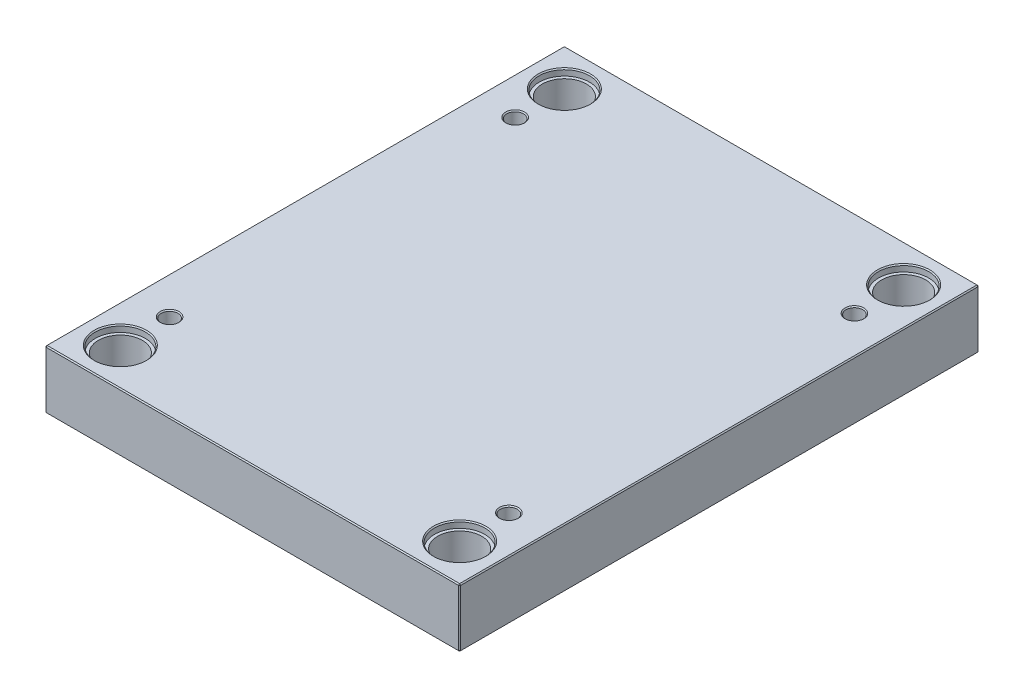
ISO-10303-21;
HEADER;
FILE_DESCRIPTION(('STEP AP214'),'2;1');
FILE_NAME('part.step','',(''),(''),'','','');
FILE_SCHEMA(('AUTOMOTIVE_DESIGN { 1 0 10303 214 1 1 1 1 }'));
ENDSEC;
DATA;
#1=APPLICATION_CONTEXT('core data for automotive mechanical design processes');
#2=APPLICATION_PROTOCOL_DEFINITION('international standard','automotive_design',2000,#1);
#3=PRODUCT_CONTEXT('',#1,'mechanical');
#4=PRODUCT('Part','Part','',(#3));
#5=PRODUCT_RELATED_PRODUCT_CATEGORY('part','',(#4));
#6=PRODUCT_DEFINITION_FORMATION('','',#4);
#7=PRODUCT_DEFINITION_CONTEXT('part definition',#1,'design');
#8=PRODUCT_DEFINITION('design','',#6,#7);
#9=PRODUCT_DEFINITION_SHAPE('','',#8);
#10=(LENGTH_UNIT() NAMED_UNIT(*) SI_UNIT(.MILLI.,.METRE.));
#11=(NAMED_UNIT(*) PLANE_ANGLE_UNIT() SI_UNIT($,.RADIAN.));
#12=(NAMED_UNIT(*) SI_UNIT($,.STERADIAN.) SOLID_ANGLE_UNIT());
#13=UNCERTAINTY_MEASURE_WITH_UNIT(LENGTH_MEASURE(1.E-05),#10,'distance_accuracy_value','');
#14=(GEOMETRIC_REPRESENTATION_CONTEXT(3) GLOBAL_UNCERTAINTY_ASSIGNED_CONTEXT((#13)) GLOBAL_UNIT_ASSIGNED_CONTEXT((#10,
#11,#12)) REPRESENTATION_CONTEXT('',''));
#15=CARTESIAN_POINT('',(0.,0.,0.));
#16=DIRECTION('',(0.,0.,1.));
#17=DIRECTION('',(1.,0.,0.));
#18=AXIS2_PLACEMENT_3D('',#15,#16,#17);
#19=CARTESIAN_POINT('',(-162.,0.,-212.));
#20=DIRECTION('',(0.,1.,0.));
#21=DIRECTION('',(0.,0.,1.));
#22=AXIS2_PLACEMENT_3D('',#19,#20,#21);
#23=CYLINDRICAL_SURFACE('',#22,21.);
#24=CARTESIAN_POINT('',(-162.,1.,-212.));
#25=DIRECTION('',(0.,1.,0.));
#26=DIRECTION('',(0.,0.,1.));
#27=AXIS2_PLACEMENT_3D('',#24,#25,#26);
#28=CIRCLE('',#27,21.);
#29=CARTESIAN_POINT('',(-162.,1.,-191.));
#30=VERTEX_POINT('',#29);
#31=EDGE_CURVE('E472',#30,#30,#28,.F.);
#32=ORIENTED_EDGE('',*,*,#31,.T.);
#33=EDGE_LOOP('',(#32));
#34=FACE_BOUND('',#33,.T.);
#35=CARTESIAN_POINT('',(-162.,49.7,-212.));
#36=DIRECTION('',(0.,1.,0.));
#37=DIRECTION('',(0.,0.,1.));
#38=AXIS2_PLACEMENT_3D('',#35,#36,#37);
#39=CIRCLE('',#38,21.);
#40=CARTESIAN_POINT('',(-162.,49.7,-191.));
#41=VERTEX_POINT('',#40);
#42=EDGE_CURVE('E221',#41,#41,#39,.F.);
#43=ORIENTED_EDGE('',*,*,#42,.F.);
#44=EDGE_LOOP('',(#43));
#45=FACE_BOUND('',#44,.T.);
#46=ADVANCED_FACE('F16',(#34,#45),#23,.F.);
#47=CARTESIAN_POINT('',(162.,0.,-212.));
#48=DIRECTION('',(0.,1.,0.));
#49=DIRECTION('',(0.,0.,1.));
#50=AXIS2_PLACEMENT_3D('',#47,#48,#49);
#51=CYLINDRICAL_SURFACE('',#50,21.);
#52=CARTESIAN_POINT('',(162.,1.,-212.));
#53=DIRECTION('',(0.,1.,0.));
#54=DIRECTION('',(0.,0.,1.));
#55=AXIS2_PLACEMENT_3D('',#52,#53,#54);
#56=CIRCLE('',#55,21.);
#57=CARTESIAN_POINT('',(162.,1.,-191.));
#58=VERTEX_POINT('',#57);
#59=EDGE_CURVE('E474',#58,#58,#56,.F.);
#60=ORIENTED_EDGE('',*,*,#59,.T.);
#61=EDGE_LOOP('',(#60));
#62=FACE_BOUND('',#61,.T.);
#63=CARTESIAN_POINT('',(162.,49.7,-212.));
#64=DIRECTION('',(0.,1.,0.));
#65=DIRECTION('',(0.,0.,1.));
#66=AXIS2_PLACEMENT_3D('',#63,#64,#65);
#67=CIRCLE('',#66,21.);
#68=CARTESIAN_POINT('',(162.,49.7,-191.));
#69=VERTEX_POINT('',#68);
#70=EDGE_CURVE('E218',#69,#69,#67,.F.);
#71=ORIENTED_EDGE('',*,*,#70,.F.);
#72=EDGE_LOOP('',(#71));
#73=FACE_BOUND('',#72,.T.);
#74=ADVANCED_FACE('F263',(#62,#73),#51,.F.);
#75=CARTESIAN_POINT('',(162.,0.,212.));
#76=DIRECTION('',(0.,1.,0.));
#77=DIRECTION('',(0.,0.,1.));
#78=AXIS2_PLACEMENT_3D('',#75,#76,#77);
#79=CYLINDRICAL_SURFACE('',#78,21.);
#80=CARTESIAN_POINT('',(162.,1.,212.));
#81=DIRECTION('',(0.,1.,0.));
#82=DIRECTION('',(0.,0.,1.));
#83=AXIS2_PLACEMENT_3D('',#80,#81,#82);
#84=CIRCLE('',#83,21.);
#85=CARTESIAN_POINT('',(162.,1.,233.));
#86=VERTEX_POINT('',#85);
#87=EDGE_CURVE('E477',#86,#86,#84,.F.);
#88=ORIENTED_EDGE('',*,*,#87,.T.);
#89=EDGE_LOOP('',(#88));
#90=FACE_BOUND('',#89,.T.);
#91=CARTESIAN_POINT('',(162.,49.7,212.));
#92=DIRECTION('',(0.,1.,0.));
#93=DIRECTION('',(0.,0.,1.));
#94=AXIS2_PLACEMENT_3D('',#91,#92,#93);
#95=CIRCLE('',#94,21.);
#96=CARTESIAN_POINT('',(162.,49.7,233.));
#97=VERTEX_POINT('',#96);
#98=EDGE_CURVE('E214',#97,#97,#95,.F.);
#99=ORIENTED_EDGE('',*,*,#98,.F.);
#100=EDGE_LOOP('',(#99));
#101=FACE_BOUND('',#100,.T.);
#102=ADVANCED_FACE('F270',(#90,#101),#79,.F.);
#103=CARTESIAN_POINT('',(-162.,0.,212.));
#104=DIRECTION('',(0.,1.,0.));
#105=DIRECTION('',(0.,0.,1.));
#106=AXIS2_PLACEMENT_3D('',#103,#104,#105);
#107=CYLINDRICAL_SURFACE('',#106,21.);
#108=CARTESIAN_POINT('',(-162.,1.,212.));
#109=DIRECTION('',(0.,1.,0.));
#110=DIRECTION('',(0.,0.,1.));
#111=AXIS2_PLACEMENT_3D('',#108,#109,#110);
#112=CIRCLE('',#111,21.);
#113=CARTESIAN_POINT('',(-162.,1.,233.));
#114=VERTEX_POINT('',#113);
#115=EDGE_CURVE('E480',#114,#114,#112,.F.);
#116=ORIENTED_EDGE('',*,*,#115,.T.);
#117=EDGE_LOOP('',(#116));
#118=FACE_BOUND('',#117,.T.);
#119=CARTESIAN_POINT('',(-162.,49.7,212.));
#120=DIRECTION('',(0.,1.,0.));
#121=DIRECTION('',(0.,0.,1.));
#122=AXIS2_PLACEMENT_3D('',#119,#120,#121);
#123=CIRCLE('',#122,21.);
#124=CARTESIAN_POINT('',(-162.,49.7,233.));
#125=VERTEX_POINT('',#124);
#126=EDGE_CURVE('E211',#125,#125,#123,.F.);
#127=ORIENTED_EDGE('',*,*,#126,.F.);
#128=EDGE_LOOP('',(#127));
#129=FACE_BOUND('',#128,.T.);
#130=ADVANCED_FACE('F277',(#118,#129),#107,.F.);
#131=CARTESIAN_POINT('',(-198.,56.,248.));
#132=DIRECTION('',(1.,0.,0.));
#133=DIRECTION('',(0.,0.,-1.));
#134=AXIS2_PLACEMENT_3D('',#131,#132,#133);
#135=PLANE('',#134);
#136=DIRECTION('',(0.,-1.,0.));
#137=VECTOR('',#136,1.);
#138=CARTESIAN_POINT('',(-198.,56.,-247.));
#139=LINE('',#138,#137);
#140=CARTESIAN_POINT('',(-198.,55.,-247.));
#141=VERTEX_POINT('',#140);
#142=CARTESIAN_POINT('',(-198.,1.00000000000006,-247.));
#143=VERTEX_POINT('',#142);
#144=EDGE_CURVE('E487',#141,#143,#139,.T.);
#145=ORIENTED_EDGE('',*,*,#144,.T.);
#146=DIRECTION('',(0.,0.,1.));
#147=VECTOR('',#146,1.);
#148=CARTESIAN_POINT('',(-198.,1.00000000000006,248.));
#149=LINE('',#148,#147);
#150=CARTESIAN_POINT('',(-198.,1.00000000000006,247.));
#151=VERTEX_POINT('',#150);
#152=EDGE_CURVE('E490',#143,#151,#149,.T.);
#153=ORIENTED_EDGE('',*,*,#152,.T.);
#154=DIRECTION('',(0.,1.,0.));
#155=VECTOR('',#154,1.);
#156=CARTESIAN_POINT('',(-198.,56.,247.));
#157=LINE('',#156,#155);
#158=CARTESIAN_POINT('',(-198.,55.,247.));
#159=VERTEX_POINT('',#158);
#160=EDGE_CURVE('E485',#151,#159,#157,.T.);
#161=ORIENTED_EDGE('',*,*,#160,.T.);
#162=DIRECTION('',(0.,0.,-1.));
#163=VECTOR('',#162,1.);
#164=CARTESIAN_POINT('',(-198.,55.,-248.));
#165=LINE('',#164,#163);
#166=EDGE_CURVE('E483',#159,#141,#165,.T.);
#167=ORIENTED_EDGE('',*,*,#166,.T.);
#168=EDGE_LOOP('',(#145,#153,#161,#167));
#169=FACE_BOUND('',#168,.T.);
#170=ADVANCED_FACE('F298',(#169),#135,.F.);
#171=CARTESIAN_POINT('',(198.,56.,248.));
#172=DIRECTION('',(0.,0.,-1.));
#173=DIRECTION('',(-1.,0.,0.));
#174=AXIS2_PLACEMENT_3D('',#171,#172,#173);
#175=PLANE('',#174);
#176=DIRECTION('',(-1.,0.,0.));
#177=VECTOR('',#176,1.);
#178=CARTESIAN_POINT('',(-198.,55.,248.));
#179=LINE('',#178,#177);
#180=CARTESIAN_POINT('',(197.,55.,248.));
#181=VERTEX_POINT('',#180);
#182=CARTESIAN_POINT('',(-197.,55.,248.));
#183=VERTEX_POINT('',#182);
#184=EDGE_CURVE('E509',#181,#183,#179,.T.);
#185=ORIENTED_EDGE('',*,*,#184,.T.);
#186=DIRECTION('',(0.,-1.,0.));
#187=VECTOR('',#186,1.);
#188=CARTESIAN_POINT('',(-197.,56.,248.));
#189=LINE('',#188,#187);
#190=CARTESIAN_POINT('',(-197.,1.00000000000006,248.));
#191=VERTEX_POINT('',#190);
#192=EDGE_CURVE('E515',#183,#191,#189,.T.);
#193=ORIENTED_EDGE('',*,*,#192,.T.);
#194=DIRECTION('',(1.,0.,0.));
#195=VECTOR('',#194,1.);
#196=CARTESIAN_POINT('',(198.,1.00000000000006,248.));
#197=LINE('',#196,#195);
#198=CARTESIAN_POINT('',(197.,1.00000000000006,248.));
#199=VERTEX_POINT('',#198);
#200=EDGE_CURVE('E513',#191,#199,#197,.T.);
#201=ORIENTED_EDGE('',*,*,#200,.T.);
#202=DIRECTION('',(0.,1.,0.));
#203=VECTOR('',#202,1.);
#204=CARTESIAN_POINT('',(197.,56.,248.));
#205=LINE('',#204,#203);
#206=EDGE_CURVE('E511',#199,#181,#205,.T.);
#207=ORIENTED_EDGE('',*,*,#206,.T.);
#208=EDGE_LOOP('',(#185,#193,#201,#207));
#209=FACE_BOUND('',#208,.T.);
#210=ADVANCED_FACE('F294',(#209),#175,.F.);
#211=CARTESIAN_POINT('',(198.,56.,248.));
#212=DIRECTION('',(-1.,0.,0.));
#213=DIRECTION('',(0.,0.,1.));
#214=AXIS2_PLACEMENT_3D('',#211,#212,#213);
#215=PLANE('',#214);
#216=DIRECTION('',(0.,0.,-1.));
#217=VECTOR('',#216,1.);
#218=CARTESIAN_POINT('',(198.,1.00000000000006,248.));
#219=LINE('',#218,#217);
#220=CARTESIAN_POINT('',(198.,1.00000000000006,247.));
#221=VERTEX_POINT('',#220);
#222=CARTESIAN_POINT('',(198.,1.00000000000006,-247.));
#223=VERTEX_POINT('',#222);
#224=EDGE_CURVE('E504',#221,#223,#219,.T.);
#225=ORIENTED_EDGE('',*,*,#224,.T.);
#226=DIRECTION('',(0.,1.,0.));
#227=VECTOR('',#226,1.);
#228=CARTESIAN_POINT('',(198.,56.,-247.));
#229=LINE('',#228,#227);
#230=CARTESIAN_POINT('',(198.,55.,-247.));
#231=VERTEX_POINT('',#230);
#232=EDGE_CURVE('E506',#223,#231,#229,.T.);
#233=ORIENTED_EDGE('',*,*,#232,.T.);
#234=DIRECTION('',(0.,0.,1.));
#235=VECTOR('',#234,1.);
#236=CARTESIAN_POINT('',(198.,55.,248.));
#237=LINE('',#236,#235);
#238=CARTESIAN_POINT('',(198.,55.,247.));
#239=VERTEX_POINT('',#238);
#240=EDGE_CURVE('E500',#231,#239,#237,.T.);
#241=ORIENTED_EDGE('',*,*,#240,.T.);
#242=DIRECTION('',(0.,-1.,0.));
#243=VECTOR('',#242,1.);
#244=CARTESIAN_POINT('',(198.,56.,247.));
#245=LINE('',#244,#243);
#246=EDGE_CURVE('E502',#239,#221,#245,.T.);
#247=ORIENTED_EDGE('',*,*,#246,.T.);
#248=EDGE_LOOP('',(#225,#233,#241,#247));
#249=FACE_BOUND('',#248,.T.);
#250=ADVANCED_FACE('F290',(#249),#215,.F.);
#251=CARTESIAN_POINT('',(198.,56.,-248.));
#252=DIRECTION('',(0.,0.,1.));
#253=DIRECTION('',(1.,0.,0.));
#254=AXIS2_PLACEMENT_3D('',#251,#252,#253);
#255=PLANE('',#254);
#256=DIRECTION('',(0.,-1.,0.));
#257=VECTOR('',#256,1.);
#258=CARTESIAN_POINT('',(197.,56.,-248.));
#259=LINE('',#258,#257);
#260=CARTESIAN_POINT('',(197.,55.,-248.));
#261=VERTEX_POINT('',#260);
#262=CARTESIAN_POINT('',(197.,1.00000000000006,-248.));
#263=VERTEX_POINT('',#262);
#264=EDGE_CURVE('E494',#261,#263,#259,.T.);
#265=ORIENTED_EDGE('',*,*,#264,.T.);
#266=DIRECTION('',(-1.,0.,0.));
#267=VECTOR('',#266,1.);
#268=CARTESIAN_POINT('',(198.,1.00000000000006,-248.));
#269=LINE('',#268,#267);
#270=CARTESIAN_POINT('',(-197.,1.00000000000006,-248.));
#271=VERTEX_POINT('',#270);
#272=EDGE_CURVE('E138',#263,#271,#269,.T.);
#273=ORIENTED_EDGE('',*,*,#272,.T.);
#274=DIRECTION('',(0.,1.,0.));
#275=VECTOR('',#274,1.);
#276=CARTESIAN_POINT('',(-197.,56.,-248.));
#277=LINE('',#276,#275);
#278=CARTESIAN_POINT('',(-197.,55.,-248.));
#279=VERTEX_POINT('',#278);
#280=EDGE_CURVE('E496',#271,#279,#277,.T.);
#281=ORIENTED_EDGE('',*,*,#280,.T.);
#282=DIRECTION('',(1.,0.,0.));
#283=VECTOR('',#282,1.);
#284=CARTESIAN_POINT('',(198.,55.,-248.));
#285=LINE('',#284,#283);
#286=EDGE_CURVE('E492',#279,#261,#285,.T.);
#287=ORIENTED_EDGE('',*,*,#286,.T.);
#288=EDGE_LOOP('',(#265,#273,#281,#287));
#289=FACE_BOUND('',#288,.T.);
#290=ADVANCED_FACE('F282',(#289),#255,.F.);
#291=CARTESIAN_POINT('',(0.,56.,0.));
#292=DIRECTION('',(0.,1.,0.));
#293=DIRECTION('',(0.,0.,1.));
#294=AXIS2_PLACEMENT_3D('',#291,#292,#293);
#295=PLANE('',#294);
#296=CARTESIAN_POINT('',(162.,56.,212.));
#297=DIRECTION('',(0.,1.,0.));
#298=DIRECTION('',(0.,0.,1.));
#299=AXIS2_PLACEMENT_3D('',#296,#297,#298);
#300=CIRCLE('',#299,25.);
#301=CARTESIAN_POINT('',(162.,56.,237.));
#302=VERTEX_POINT('',#301);
#303=EDGE_CURVE('E236',#302,#302,#300,.F.);
#304=ORIENTED_EDGE('',*,*,#303,.T.);
#305=EDGE_LOOP('',(#304));
#306=FACE_BOUND('',#305,.T.);
#307=CARTESIAN_POINT('',(-162.,56.,212.));
#308=DIRECTION('',(0.,1.,0.));
#309=DIRECTION('',(0.,0.,1.));
#310=AXIS2_PLACEMENT_3D('',#307,#308,#309);
#311=CIRCLE('',#310,25.);
#312=CARTESIAN_POINT('',(-162.,56.,237.));
#313=VERTEX_POINT('',#312);
#314=EDGE_CURVE('E233',#313,#313,#311,.F.);
#315=ORIENTED_EDGE('',*,*,#314,.T.);
#316=EDGE_LOOP('',(#315));
#317=FACE_BOUND('',#316,.T.);
#318=CARTESIAN_POINT('',(162.,56.,-212.));
#319=DIRECTION('',(0.,1.,0.));
#320=DIRECTION('',(0.,0.,1.));
#321=AXIS2_PLACEMENT_3D('',#318,#319,#320);
#322=CIRCLE('',#321,25.);
#323=CARTESIAN_POINT('',(162.,56.,-187.));
#324=VERTEX_POINT('',#323);
#325=EDGE_CURVE('E230',#324,#324,#322,.F.);
#326=ORIENTED_EDGE('',*,*,#325,.T.);
#327=EDGE_LOOP('',(#326));
#328=FACE_BOUND('',#327,.T.);
#329=CARTESIAN_POINT('',(-162.,56.,-212.));
#330=DIRECTION('',(0.,1.,0.));
#331=DIRECTION('',(0.,0.,1.));
#332=AXIS2_PLACEMENT_3D('',#329,#330,#331);
#333=CIRCLE('',#332,25.);
#334=CARTESIAN_POINT('',(-162.,56.,-187.));
#335=VERTEX_POINT('',#334);
#336=EDGE_CURVE('E227',#335,#335,#333,.F.);
#337=ORIENTED_EDGE('',*,*,#336,.T.);
#338=EDGE_LOOP('',(#337));
#339=FACE_BOUND('',#338,.T.);
#340=CARTESIAN_POINT('',(-162.,56.,165.));
#341=DIRECTION('',(0.,1.,0.));
#342=DIRECTION('',(0.,0.,1.));
#343=AXIS2_PLACEMENT_3D('',#340,#341,#342);
#344=CIRCLE('',#343,9.00000000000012);
#345=CARTESIAN_POINT('',(-162.,56.,174.));
#346=VERTEX_POINT('',#345);
#347=EDGE_CURVE('E198',#346,#346,#344,.F.);
#348=ORIENTED_EDGE('',*,*,#347,.T.);
#349=EDGE_LOOP('',(#348));
#350=FACE_BOUND('',#349,.T.);
#351=CARTESIAN_POINT('',(162.,56.,165.));
#352=DIRECTION('',(0.,1.,0.));
#353=DIRECTION('',(0.,0.,1.));
#354=AXIS2_PLACEMENT_3D('',#351,#352,#353);
#355=CIRCLE('',#354,9.00000000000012);
#356=CARTESIAN_POINT('',(162.,56.,174.));
#357=VERTEX_POINT('',#356);
#358=EDGE_CURVE('E195',#357,#357,#355,.F.);
#359=ORIENTED_EDGE('',*,*,#358,.T.);
#360=EDGE_LOOP('',(#359));
#361=FACE_BOUND('',#360,.T.);
#362=CARTESIAN_POINT('',(162.,56.,-165.));
#363=DIRECTION('',(0.,1.,0.));
#364=DIRECTION('',(0.,0.,1.));
#365=AXIS2_PLACEMENT_3D('',#362,#363,#364);
#366=CIRCLE('',#365,9.00000000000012);
#367=CARTESIAN_POINT('',(162.,56.,-156.));
#368=VERTEX_POINT('',#367);
#369=EDGE_CURVE('E192',#368,#368,#366,.F.);
#370=ORIENTED_EDGE('',*,*,#369,.T.);
#371=EDGE_LOOP('',(#370));
#372=FACE_BOUND('',#371,.T.);
#373=CARTESIAN_POINT('',(-162.,56.,-165.));
#374=DIRECTION('',(0.,1.,0.));
#375=DIRECTION('',(0.,0.,1.));
#376=AXIS2_PLACEMENT_3D('',#373,#374,#375);
#377=CIRCLE('',#376,9.00000000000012);
#378=CARTESIAN_POINT('',(-162.,56.,-156.));
#379=VERTEX_POINT('',#378);
#380=EDGE_CURVE('E188',#379,#379,#377,.F.);
#381=ORIENTED_EDGE('',*,*,#380,.T.);
#382=EDGE_LOOP('',(#381));
#383=FACE_BOUND('',#382,.T.);
#384=DIRECTION('',(0.,0.,-1.));
#385=VECTOR('',#384,1.);
#386=CARTESIAN_POINT('',(197.,56.,-248.));
#387=LINE('',#386,#385);
#388=CARTESIAN_POINT('',(197.,56.,247.));
#389=VERTEX_POINT('',#388);
#390=CARTESIAN_POINT('',(197.,56.,-247.));
#391=VERTEX_POINT('',#390);
#392=EDGE_CURVE('E31',#389,#391,#387,.T.);
#393=ORIENTED_EDGE('',*,*,#392,.T.);
#394=DIRECTION('',(-1.,0.,0.));
#395=VECTOR('',#394,1.);
#396=CARTESIAN_POINT('',(-198.,56.,-247.));
#397=LINE('',#396,#395);
#398=CARTESIAN_POINT('',(-197.,56.,-247.));
#399=VERTEX_POINT('',#398);
#400=EDGE_CURVE('E189',#391,#399,#397,.T.);
#401=ORIENTED_EDGE('',*,*,#400,.T.);
#402=DIRECTION('',(0.,0.,1.));
#403=VECTOR('',#402,1.);
#404=CARTESIAN_POINT('',(-197.,56.,248.));
#405=LINE('',#404,#403);
#406=CARTESIAN_POINT('',(-197.,56.,247.));
#407=VERTEX_POINT('',#406);
#408=EDGE_CURVE('E518',#399,#407,#405,.T.);
#409=ORIENTED_EDGE('',*,*,#408,.T.);
#410=DIRECTION('',(1.,0.,0.));
#411=VECTOR('',#410,1.);
#412=CARTESIAN_POINT('',(198.,56.,247.));
#413=LINE('',#412,#411);
#414=EDGE_CURVE('E36',#407,#389,#413,.T.);
#415=ORIENTED_EDGE('',*,*,#414,.T.);
#416=EDGE_LOOP('',(#393,#401,#409,#415));
#417=FACE_BOUND('',#416,.T.);
#418=ADVANCED_FACE('F279',(#306,#317,#328,#339,#350,#361,#372,#383,#417),#295,.T.);
#419=CARTESIAN_POINT('',(0.,0.,0.));
#420=DIRECTION('',(0.,1.,0.));
#421=DIRECTION('',(0.,0.,1.));
#422=AXIS2_PLACEMENT_3D('',#419,#420,#421);
#423=PLANE('',#422);
#424=CARTESIAN_POINT('',(-162.,0.,-212.));
#425=DIRECTION('',(0.,1.,0.));
#426=DIRECTION('',(0.,0.,1.));
#427=AXIS2_PLACEMENT_3D('',#424,#425,#426);
#428=CIRCLE('',#427,22.);
#429=CARTESIAN_POINT('',(-162.,0.,-190.));
#430=VERTEX_POINT('',#429);
#431=EDGE_CURVE('E469',#430,#430,#428,.T.);
#432=ORIENTED_EDGE('',*,*,#431,.T.);
#433=EDGE_LOOP('',(#432));
#434=FACE_BOUND('',#433,.T.);
#435=CARTESIAN_POINT('',(162.,0.,-212.));
#436=DIRECTION('',(0.,1.,0.));
#437=DIRECTION('',(0.,0.,1.));
#438=AXIS2_PLACEMENT_3D('',#435,#436,#437);
#439=CIRCLE('',#438,22.);
#440=CARTESIAN_POINT('',(162.,0.,-190.));
#441=VERTEX_POINT('',#440);
#442=EDGE_CURVE('E466',#441,#441,#439,.T.);
#443=ORIENTED_EDGE('',*,*,#442,.T.);
#444=EDGE_LOOP('',(#443));
#445=FACE_BOUND('',#444,.T.);
#446=CARTESIAN_POINT('',(162.,0.,212.));
#447=DIRECTION('',(0.,1.,0.));
#448=DIRECTION('',(0.,0.,1.));
#449=AXIS2_PLACEMENT_3D('',#446,#447,#448);
#450=CIRCLE('',#449,22.);
#451=CARTESIAN_POINT('',(162.,0.,234.));
#452=VERTEX_POINT('',#451);
#453=EDGE_CURVE('E463',#452,#452,#450,.T.);
#454=ORIENTED_EDGE('',*,*,#453,.T.);
#455=EDGE_LOOP('',(#454));
#456=FACE_BOUND('',#455,.T.);
#457=CARTESIAN_POINT('',(-162.,0.,212.));
#458=DIRECTION('',(0.,1.,0.));
#459=DIRECTION('',(0.,0.,1.));
#460=AXIS2_PLACEMENT_3D('',#457,#458,#459);
#461=CIRCLE('',#460,22.);
#462=CARTESIAN_POINT('',(-162.,0.,234.));
#463=VERTEX_POINT('',#462);
#464=EDGE_CURVE('E460',#463,#463,#461,.T.);
#465=ORIENTED_EDGE('',*,*,#464,.T.);
#466=EDGE_LOOP('',(#465));
#467=FACE_BOUND('',#466,.T.);
#468=DIRECTION('',(0.,0.,1.));
#469=VECTOR('',#468,1.);
#470=CARTESIAN_POINT('',(197.,0.,0.));
#471=LINE('',#470,#469);
#472=CARTESIAN_POINT('',(197.,0.,-247.));
#473=VERTEX_POINT('',#472);
#474=CARTESIAN_POINT('',(197.,0.,247.));
#475=VERTEX_POINT('',#474);
#476=EDGE_CURVE('E108',#473,#475,#471,.T.);
#477=ORIENTED_EDGE('',*,*,#476,.T.);
#478=DIRECTION('',(-1.,0.,0.));
#479=VECTOR('',#478,1.);
#480=CARTESIAN_POINT('',(0.,0.,247.));
#481=LINE('',#480,#479);
#482=CARTESIAN_POINT('',(-197.,0.,247.));
#483=VERTEX_POINT('',#482);
#484=EDGE_CURVE('E458',#475,#483,#481,.T.);
#485=ORIENTED_EDGE('',*,*,#484,.T.);
#486=DIRECTION('',(0.,0.,-1.));
#487=VECTOR('',#486,1.);
#488=CARTESIAN_POINT('',(-197.,0.,0.));
#489=LINE('',#488,#487);
#490=CARTESIAN_POINT('',(-197.,0.,-247.));
#491=VERTEX_POINT('',#490);
#492=EDGE_CURVE('E110',#483,#491,#489,.T.);
#493=ORIENTED_EDGE('',*,*,#492,.T.);
#494=DIRECTION('',(1.,0.,0.));
#495=VECTOR('',#494,1.);
#496=CARTESIAN_POINT('',(0.,0.,-247.));
#497=LINE('',#496,#495);
#498=EDGE_CURVE('E104',#491,#473,#497,.T.);
#499=ORIENTED_EDGE('',*,*,#498,.T.);
#500=EDGE_LOOP('',(#477,#485,#493,#499));
#501=FACE_BOUND('',#500,.T.);
#502=ADVANCED_FACE('F106',(#434,#445,#456,#467,#501),#423,.F.);
#503=CARTESIAN_POINT('',(-162.,0.,-212.));
#504=DIRECTION('',(0.,-1.,0.));
#505=DIRECTION('',(0.,0.,-1.));
#506=AXIS2_PLACEMENT_3D('',#503,#504,#505);
#507=CONICAL_SURFACE('',#506,22.,0.785398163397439);
#508=ORIENTED_EDGE('',*,*,#31,.F.);
#509=EDGE_LOOP('',(#508));
#510=FACE_BOUND('',#509,.T.);
#511=ORIENTED_EDGE('',*,*,#431,.F.);
#512=EDGE_LOOP('',(#511));
#513=FACE_BOUND('',#512,.T.);
#514=ADVANCED_FACE('F286',(#510,#513),#507,.F.);
#515=CARTESIAN_POINT('',(162.,0.,-212.));
#516=DIRECTION('',(0.,-1.,0.));
#517=DIRECTION('',(0.,0.,-1.));
#518=AXIS2_PLACEMENT_3D('',#515,#516,#517);
#519=CONICAL_SURFACE('',#518,22.,0.785398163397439);
#520=ORIENTED_EDGE('',*,*,#59,.F.);
#521=EDGE_LOOP('',(#520));
#522=FACE_BOUND('',#521,.T.);
#523=ORIENTED_EDGE('',*,*,#442,.F.);
#524=EDGE_LOOP('',(#523));
#525=FACE_BOUND('',#524,.T.);
#526=ADVANCED_FACE('F305',(#522,#525),#519,.F.);
#527=CARTESIAN_POINT('',(162.,0.,212.));
#528=DIRECTION('',(0.,-1.,0.));
#529=DIRECTION('',(0.,0.,-1.));
#530=AXIS2_PLACEMENT_3D('',#527,#528,#529);
#531=CONICAL_SURFACE('',#530,22.,0.785398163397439);
#532=ORIENTED_EDGE('',*,*,#87,.F.);
#533=EDGE_LOOP('',(#532));
#534=FACE_BOUND('',#533,.T.);
#535=ORIENTED_EDGE('',*,*,#453,.F.);
#536=EDGE_LOOP('',(#535));
#537=FACE_BOUND('',#536,.T.);
#538=ADVANCED_FACE('F309',(#534,#537),#531,.F.);
#539=CARTESIAN_POINT('',(-162.,0.,212.));
#540=DIRECTION('',(0.,-1.,0.));
#541=DIRECTION('',(0.,0.,-1.));
#542=AXIS2_PLACEMENT_3D('',#539,#540,#541);
#543=CONICAL_SURFACE('',#542,22.,0.785398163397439);
#544=ORIENTED_EDGE('',*,*,#115,.F.);
#545=EDGE_LOOP('',(#544));
#546=FACE_BOUND('',#545,.T.);
#547=ORIENTED_EDGE('',*,*,#464,.F.);
#548=EDGE_LOOP('',(#547));
#549=FACE_BOUND('',#548,.T.);
#550=ADVANCED_FACE('F313',(#546,#549),#543,.F.);
#551=CARTESIAN_POINT('',(198.,56.,247.));
#552=DIRECTION('',(-0.707106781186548,0.,-0.707106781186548));
#553=DIRECTION('',(0.,-1.,0.));
#554=AXIS2_PLACEMENT_3D('',#551,#552,#553);
#555=PLANE('',#554);
#556=DIRECTION('',(-0.707106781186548,0.,0.707106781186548));
#557=VECTOR('',#556,1.);
#558=CARTESIAN_POINT('',(197.,55.,248.));
#559=LINE('',#558,#557);
#560=EDGE_CURVE('E126',#181,#239,#559,.F.);
#561=ORIENTED_EDGE('',*,*,#560,.F.);
#562=ORIENTED_EDGE('',*,*,#206,.F.);
#563=DIRECTION('',(0.707106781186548,0.,-0.707106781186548));
#564=VECTOR('',#563,1.);
#565=CARTESIAN_POINT('',(197.,1.00000000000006,248.));
#566=LINE('',#565,#564);
#567=EDGE_CURVE('E180',#221,#199,#566,.F.);
#568=ORIENTED_EDGE('',*,*,#567,.F.);
#569=ORIENTED_EDGE('',*,*,#246,.F.);
#570=EDGE_LOOP('',(#561,#562,#568,#569));
#571=FACE_BOUND('',#570,.T.);
#572=ADVANCED_FACE('F317',(#571),#555,.F.);
#573=CARTESIAN_POINT('',(197.,55.,248.));
#574=DIRECTION('',(0.577350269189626,0.577350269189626,0.577350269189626));
#575=DIRECTION('',(0.707106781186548,0.,-0.707106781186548));
#576=AXIS2_PLACEMENT_3D('',#573,#574,#575);
#577=PLANE('',#576);
#578=DIRECTION('',(0.,-0.707106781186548,0.707106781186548));
#579=VECTOR('',#578,1.);
#580=CARTESIAN_POINT('',(197.,55.,248.));
#581=LINE('',#580,#579);
#582=EDGE_CURVE('E175',#181,#389,#581,.F.);
#583=ORIENTED_EDGE('',*,*,#582,.F.);
#584=ORIENTED_EDGE('',*,*,#560,.T.);
#585=DIRECTION('',(-0.707106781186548,0.707106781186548,0.));
#586=VECTOR('',#585,1.);
#587=CARTESIAN_POINT('',(197.5,55.5,247.));
#588=LINE('',#587,#586);
#589=EDGE_CURVE('E177',#389,#239,#588,.F.);
#590=ORIENTED_EDGE('',*,*,#589,.F.);
#591=EDGE_LOOP('',(#583,#584,#590));
#592=FACE_BOUND('',#591,.T.);
#593=ADVANCED_FACE('F385',(#592),#577,.T.);
#594=CARTESIAN_POINT('',(197.,1.00000000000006,248.));
#595=DIRECTION('',(0.577350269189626,-0.577350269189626,0.577350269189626));
#596=DIRECTION('',(0.707106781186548,0.,-0.707106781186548));
#597=AXIS2_PLACEMENT_3D('',#594,#595,#596);
#598=PLANE('',#597);
#599=DIRECTION('',(-0.707106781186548,-0.707106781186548,0.));
#600=VECTOR('',#599,1.);
#601=CARTESIAN_POINT('',(197.5,0.500000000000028,247.));
#602=LINE('',#601,#600);
#603=EDGE_CURVE('E124',#221,#475,#602,.T.);
#604=ORIENTED_EDGE('',*,*,#603,.F.);
#605=ORIENTED_EDGE('',*,*,#567,.T.);
#606=DIRECTION('',(0.,0.707106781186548,0.707106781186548));
#607=VECTOR('',#606,1.);
#608=CARTESIAN_POINT('',(197.,1.00000000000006,248.));
#609=LINE('',#608,#607);
#610=EDGE_CURVE('E172',#475,#199,#609,.T.);
#611=ORIENTED_EDGE('',*,*,#610,.F.);
#612=EDGE_LOOP('',(#604,#605,#611));
#613=FACE_BOUND('',#612,.T.);
#614=ADVANCED_FACE('F381',(#613),#598,.T.);
#615=CARTESIAN_POINT('',(197.,56.,0.));
#616=DIRECTION('',(0.707106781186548,0.707106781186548,0.));
#617=DIRECTION('',(0.,0.,1.));
#618=AXIS2_PLACEMENT_3D('',#615,#616,#617);
#619=PLANE('',#618);
#620=ORIENTED_EDGE('',*,*,#589,.T.);
#621=ORIENTED_EDGE('',*,*,#240,.F.);
#622=DIRECTION('',(0.707106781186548,-0.707106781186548,0.));
#623=VECTOR('',#622,1.);
#624=CARTESIAN_POINT('',(198.,55.,-247.));
#625=LINE('',#624,#623);
#626=EDGE_CURVE('E166',#391,#231,#625,.T.);
#627=ORIENTED_EDGE('',*,*,#626,.F.);
#628=ORIENTED_EDGE('',*,*,#392,.F.);
#629=EDGE_LOOP('',(#620,#621,#627,#628));
#630=FACE_BOUND('',#629,.T.);
#631=ADVANCED_FACE('F377',(#630),#619,.T.);
#632=CARTESIAN_POINT('',(0.,56.,247.));
#633=DIRECTION('',(0.,0.707106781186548,0.707106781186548));
#634=DIRECTION('',(-1.,0.,0.));
#635=AXIS2_PLACEMENT_3D('',#632,#633,#634);
#636=PLANE('',#635);
#637=ORIENTED_EDGE('',*,*,#582,.T.);
#638=ORIENTED_EDGE('',*,*,#414,.F.);
#639=DIRECTION('',(0.,0.707106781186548,-0.707106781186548));
#640=VECTOR('',#639,1.);
#641=CARTESIAN_POINT('',(-197.,55.5,247.5));
#642=LINE('',#641,#640);
#643=EDGE_CURVE('E163',#183,#407,#642,.T.);
#644=ORIENTED_EDGE('',*,*,#643,.F.);
#645=ORIENTED_EDGE('',*,*,#184,.F.);
#646=EDGE_LOOP('',(#637,#638,#644,#645));
#647=FACE_BOUND('',#646,.T.);
#648=ADVANCED_FACE('F373',(#647),#636,.T.);
#649=CARTESIAN_POINT('',(-197.,56.,248.));
#650=DIRECTION('',(0.707106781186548,0.,-0.707106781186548));
#651=DIRECTION('',(0.,-1.,0.));
#652=AXIS2_PLACEMENT_3D('',#649,#650,#651);
#653=PLANE('',#652);
#654=DIRECTION('',(0.707106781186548,0.,0.707106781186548));
#655=VECTOR('',#654,1.);
#656=CARTESIAN_POINT('',(-197.,1.00000000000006,248.));
#657=LINE('',#656,#655);
#658=EDGE_CURVE('E157',#191,#151,#657,.F.);
#659=ORIENTED_EDGE('',*,*,#658,.F.);
#660=ORIENTED_EDGE('',*,*,#192,.F.);
#661=DIRECTION('',(-0.707106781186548,0.,-0.707106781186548));
#662=VECTOR('',#661,1.);
#663=CARTESIAN_POINT('',(-198.,55.,247.));
#664=LINE('',#663,#662);
#665=EDGE_CURVE('E160',#159,#183,#664,.F.);
#666=ORIENTED_EDGE('',*,*,#665,.F.);
#667=ORIENTED_EDGE('',*,*,#160,.F.);
#668=EDGE_LOOP('',(#659,#660,#666,#667));
#669=FACE_BOUND('',#668,.T.);
#670=ADVANCED_FACE('F369',(#669),#653,.F.);
#671=CARTESIAN_POINT('',(198.,1.00000000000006,248.));
#672=DIRECTION('',(0.,0.707106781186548,-0.707106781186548));
#673=DIRECTION('',(1.,0.,0.));
#674=AXIS2_PLACEMENT_3D('',#671,#672,#673);
#675=PLANE('',#674);
#676=ORIENTED_EDGE('',*,*,#610,.T.);
#677=ORIENTED_EDGE('',*,*,#200,.F.);
#678=DIRECTION('',(0.,-0.707106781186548,-0.707106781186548));
#679=VECTOR('',#678,1.);
#680=CARTESIAN_POINT('',(-197.,1.00000000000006,248.));
#681=LINE('',#680,#679);
#682=EDGE_CURVE('E135',#483,#191,#681,.F.);
#683=ORIENTED_EDGE('',*,*,#682,.F.);
#684=ORIENTED_EDGE('',*,*,#484,.F.);
#685=EDGE_LOOP('',(#676,#677,#683,#684));
#686=FACE_BOUND('',#685,.T.);
#687=ADVANCED_FACE('F366',(#686),#675,.F.);
#688=CARTESIAN_POINT('',(198.,1.00000000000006,248.));
#689=DIRECTION('',(-0.707106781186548,0.707106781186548,0.));
#690=DIRECTION('',(0.,0.,-1.));
#691=AXIS2_PLACEMENT_3D('',#688,#689,#690);
#692=PLANE('',#691);
#693=ORIENTED_EDGE('',*,*,#603,.T.);
#694=ORIENTED_EDGE('',*,*,#476,.F.);
#695=DIRECTION('',(0.707106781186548,0.707106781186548,0.));
#696=VECTOR('',#695,1.);
#697=CARTESIAN_POINT('',(197.5,0.500000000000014,-247.));
#698=LINE('',#697,#696);
#699=EDGE_CURVE('E121',#223,#473,#698,.F.);
#700=ORIENTED_EDGE('',*,*,#699,.F.);
#701=ORIENTED_EDGE('',*,*,#224,.F.);
#702=EDGE_LOOP('',(#693,#694,#700,#701));
#703=FACE_BOUND('',#702,.T.);
#704=ADVANCED_FACE('F119',(#703),#692,.F.);
#705=CARTESIAN_POINT('',(197.,56.,-248.));
#706=DIRECTION('',(-0.707106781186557,0.,0.707106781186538));
#707=DIRECTION('',(0.,-1.,0.));
#708=AXIS2_PLACEMENT_3D('',#705,#706,#707);
#709=PLANE('',#708);
#710=DIRECTION('',(0.707106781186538,0.,0.707106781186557));
#711=VECTOR('',#710,1.);
#712=CARTESIAN_POINT('',(198.,55.,-247.));
#713=LINE('',#712,#711);
#714=EDGE_CURVE('E168',#231,#261,#713,.F.);
#715=ORIENTED_EDGE('',*,*,#714,.F.);
#716=ORIENTED_EDGE('',*,*,#232,.F.);
#717=DIRECTION('',(-0.707106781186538,0.,-0.707106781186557));
#718=VECTOR('',#717,1.);
#719=CARTESIAN_POINT('',(197.,1.00000000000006,-248.));
#720=LINE('',#719,#718);
#721=EDGE_CURVE('E134',#263,#223,#720,.F.);
#722=ORIENTED_EDGE('',*,*,#721,.F.);
#723=ORIENTED_EDGE('',*,*,#264,.F.);
#724=EDGE_LOOP('',(#715,#716,#722,#723));
#725=FACE_BOUND('',#724,.T.);
#726=ADVANCED_FACE('F359',(#725),#709,.F.);
#727=CARTESIAN_POINT('',(198.,55.,-247.));
#728=DIRECTION('',(0.577350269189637,0.57735026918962,-0.57735026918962));
#729=DIRECTION('',(-0.707106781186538,0.,-0.707106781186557));
#730=AXIS2_PLACEMENT_3D('',#727,#728,#729);
#731=PLANE('',#730);
#732=ORIENTED_EDGE('',*,*,#626,.T.);
#733=ORIENTED_EDGE('',*,*,#714,.T.);
#734=DIRECTION('',(0.,0.707106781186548,0.707106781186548));
#735=VECTOR('',#734,1.);
#736=CARTESIAN_POINT('',(197.,55.5,-247.5));
#737=LINE('',#736,#735);
#738=EDGE_CURVE('E152',#391,#261,#737,.F.);
#739=ORIENTED_EDGE('',*,*,#738,.F.);
#740=EDGE_LOOP('',(#732,#733,#739));
#741=FACE_BOUND('',#740,.T.);
#742=ADVANCED_FACE('F355',(#741),#731,.T.);
#743=CARTESIAN_POINT('',(-198.,55.,247.));
#744=DIRECTION('',(-0.577350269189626,0.577350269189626,0.577350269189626));
#745=DIRECTION('',(0.707106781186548,0.,0.707106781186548));
#746=AXIS2_PLACEMENT_3D('',#743,#744,#745);
#747=PLANE('',#746);
#748=ORIENTED_EDGE('',*,*,#665,.T.);
#749=ORIENTED_EDGE('',*,*,#643,.T.);
#750=DIRECTION('',(-0.707106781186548,-0.707106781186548,0.));
#751=VECTOR('',#750,1.);
#752=CARTESIAN_POINT('',(-198.,55.,247.));
#753=LINE('',#752,#751);
#754=EDGE_CURVE('E143',#159,#407,#753,.F.);
#755=ORIENTED_EDGE('',*,*,#754,.F.);
#756=EDGE_LOOP('',(#748,#749,#755));
#757=FACE_BOUND('',#756,.T.);
#758=ADVANCED_FACE('F351',(#757),#747,.T.);
#759=CARTESIAN_POINT('',(-197.,1.00000000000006,248.));
#760=DIRECTION('',(-0.577350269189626,-0.577350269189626,0.577350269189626));
#761=DIRECTION('',(0.707106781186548,0.,0.707106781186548));
#762=AXIS2_PLACEMENT_3D('',#759,#760,#761);
#763=PLANE('',#762);
#764=ORIENTED_EDGE('',*,*,#682,.T.);
#765=ORIENTED_EDGE('',*,*,#658,.T.);
#766=DIRECTION('',(-0.707106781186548,0.707106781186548,0.));
#767=VECTOR('',#766,1.);
#768=CARTESIAN_POINT('',(-197.5,0.500000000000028,247.));
#769=LINE('',#768,#767);
#770=EDGE_CURVE('E139',#483,#151,#769,.T.);
#771=ORIENTED_EDGE('',*,*,#770,.F.);
#772=EDGE_LOOP('',(#764,#765,#771));
#773=FACE_BOUND('',#772,.T.);
#774=ADVANCED_FACE('F348',(#773),#763,.T.);
#775=CARTESIAN_POINT('',(197.,1.00000000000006,-248.));
#776=DIRECTION('',(0.577350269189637,-0.57735026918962,-0.57735026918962));
#777=DIRECTION('',(-0.707106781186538,0.,-0.707106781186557));
#778=AXIS2_PLACEMENT_3D('',#775,#776,#777);
#779=PLANE('',#778);
#780=ORIENTED_EDGE('',*,*,#721,.T.);
#781=ORIENTED_EDGE('',*,*,#699,.T.);
#782=DIRECTION('',(0.,-0.707106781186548,0.707106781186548));
#783=VECTOR('',#782,1.);
#784=CARTESIAN_POINT('',(197.,1.00000000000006,-248.));
#785=LINE('',#784,#783);
#786=EDGE_CURVE('E131',#263,#473,#785,.T.);
#787=ORIENTED_EDGE('',*,*,#786,.F.);
#788=EDGE_LOOP('',(#780,#781,#787));
#789=FACE_BOUND('',#788,.T.);
#790=ADVANCED_FACE('F130',(#789),#779,.T.);
#791=CARTESIAN_POINT('',(0.,56.,-247.));
#792=DIRECTION('',(0.,0.707106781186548,-0.707106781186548));
#793=DIRECTION('',(1.,0.,0.));
#794=AXIS2_PLACEMENT_3D('',#791,#792,#793);
#795=PLANE('',#794);
#796=ORIENTED_EDGE('',*,*,#738,.T.);
#797=ORIENTED_EDGE('',*,*,#286,.F.);
#798=DIRECTION('',(0.,-0.707106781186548,-0.707106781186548));
#799=VECTOR('',#798,1.);
#800=CARTESIAN_POINT('',(-197.,55.,-248.));
#801=LINE('',#800,#799);
#802=EDGE_CURVE('E140',#399,#279,#801,.T.);
#803=ORIENTED_EDGE('',*,*,#802,.F.);
#804=ORIENTED_EDGE('',*,*,#400,.F.);
#805=EDGE_LOOP('',(#796,#797,#803,#804));
#806=FACE_BOUND('',#805,.T.);
#807=ADVANCED_FACE('F341',(#806),#795,.T.);
#808=CARTESIAN_POINT('',(-197.,56.,0.));
#809=DIRECTION('',(-0.707106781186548,0.707106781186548,0.));
#810=DIRECTION('',(0.,0.,-1.));
#811=AXIS2_PLACEMENT_3D('',#808,#809,#810);
#812=PLANE('',#811);
#813=ORIENTED_EDGE('',*,*,#754,.T.);
#814=ORIENTED_EDGE('',*,*,#408,.F.);
#815=DIRECTION('',(0.707106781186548,0.707106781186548,0.));
#816=VECTOR('',#815,1.);
#817=CARTESIAN_POINT('',(-197.5,55.5,-247.));
#818=LINE('',#817,#816);
#819=EDGE_CURVE('E146',#141,#399,#818,.T.);
#820=ORIENTED_EDGE('',*,*,#819,.F.);
#821=ORIENTED_EDGE('',*,*,#166,.F.);
#822=EDGE_LOOP('',(#813,#814,#820,#821));
#823=FACE_BOUND('',#822,.T.);
#824=ADVANCED_FACE('F337',(#823),#812,.T.);
#825=CARTESIAN_POINT('',(-198.,1.00000000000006,248.));
#826=DIRECTION('',(0.707106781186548,0.707106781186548,0.));
#827=DIRECTION('',(0.,0.,1.));
#828=AXIS2_PLACEMENT_3D('',#825,#826,#827);
#829=PLANE('',#828);
#830=ORIENTED_EDGE('',*,*,#770,.T.);
#831=ORIENTED_EDGE('',*,*,#152,.F.);
#832=DIRECTION('',(0.707106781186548,-0.707106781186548,0.));
#833=VECTOR('',#832,1.);
#834=CARTESIAN_POINT('',(-198.,1.00000000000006,-247.));
#835=LINE('',#834,#833);
#836=EDGE_CURVE('E529',#491,#143,#835,.F.);
#837=ORIENTED_EDGE('',*,*,#836,.F.);
#838=ORIENTED_EDGE('',*,*,#492,.F.);
#839=EDGE_LOOP('',(#830,#831,#837,#838));
#840=FACE_BOUND('',#839,.T.);
#841=ADVANCED_FACE('F334',(#840),#829,.F.);
#842=CARTESIAN_POINT('',(198.,1.00000000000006,-248.));
#843=DIRECTION('',(0.,0.707106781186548,0.707106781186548));
#844=DIRECTION('',(-1.,0.,0.));
#845=AXIS2_PLACEMENT_3D('',#842,#843,#844);
#846=PLANE('',#845);
#847=ORIENTED_EDGE('',*,*,#786,.T.);
#848=ORIENTED_EDGE('',*,*,#498,.F.);
#849=DIRECTION('',(0.,0.707106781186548,-0.707106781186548));
#850=VECTOR('',#849,1.);
#851=CARTESIAN_POINT('',(-197.,0.500000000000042,-247.5));
#852=LINE('',#851,#850);
#853=EDGE_CURVE('E526',#271,#491,#852,.F.);
#854=ORIENTED_EDGE('',*,*,#853,.F.);
#855=ORIENTED_EDGE('',*,*,#272,.F.);
#856=EDGE_LOOP('',(#847,#848,#854,#855));
#857=FACE_BOUND('',#856,.T.);
#858=ADVANCED_FACE('F137',(#857),#846,.F.);
#859=CARTESIAN_POINT('',(-197.,55.,-248.));
#860=DIRECTION('',(-0.577350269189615,0.577350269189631,-0.577350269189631));
#861=DIRECTION('',(0.,0.707106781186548,0.707106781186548));
#862=AXIS2_PLACEMENT_3D('',#859,#860,#861);
#863=PLANE('',#862);
#864=ORIENTED_EDGE('',*,*,#819,.T.);
#865=ORIENTED_EDGE('',*,*,#802,.T.);
#866=DIRECTION('',(0.707106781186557,0.,-0.707106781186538));
#867=VECTOR('',#866,1.);
#868=CARTESIAN_POINT('',(-197.,55.,-248.));
#869=LINE('',#868,#867);
#870=EDGE_CURVE('E524',#141,#279,#869,.T.);
#871=ORIENTED_EDGE('',*,*,#870,.F.);
#872=EDGE_LOOP('',(#864,#865,#871));
#873=FACE_BOUND('',#872,.T.);
#874=ADVANCED_FACE('F327',(#873),#863,.T.);
#875=CARTESIAN_POINT('',(-198.,1.00000000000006,-247.));
#876=DIRECTION('',(-0.577350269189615,-0.577350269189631,-0.577350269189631));
#877=DIRECTION('',(0.,0.707106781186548,-0.707106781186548));
#878=AXIS2_PLACEMENT_3D('',#875,#876,#877);
#879=PLANE('',#878);
#880=ORIENTED_EDGE('',*,*,#853,.T.);
#881=ORIENTED_EDGE('',*,*,#836,.T.);
#882=DIRECTION('',(-0.707106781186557,0.,0.707106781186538));
#883=VECTOR('',#882,1.);
#884=CARTESIAN_POINT('',(-198.,1.00000000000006,-247.));
#885=LINE('',#884,#883);
#886=EDGE_CURVE('E455',#271,#143,#885,.T.);
#887=ORIENTED_EDGE('',*,*,#886,.F.);
#888=EDGE_LOOP('',(#880,#881,#887));
#889=FACE_BOUND('',#888,.T.);
#890=ADVANCED_FACE('F323',(#889),#879,.T.);
#891=CARTESIAN_POINT('',(-198.,56.,-247.));
#892=DIRECTION('',(0.707106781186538,0.,0.707106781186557));
#893=DIRECTION('',(0.,-1.,0.));
#894=AXIS2_PLACEMENT_3D('',#891,#892,#893);
#895=PLANE('',#894);
#896=ORIENTED_EDGE('',*,*,#870,.T.);
#897=ORIENTED_EDGE('',*,*,#280,.F.);
#898=ORIENTED_EDGE('',*,*,#886,.T.);
#899=ORIENTED_EDGE('',*,*,#144,.F.);
#900=EDGE_LOOP('',(#896,#897,#898,#899));
#901=FACE_BOUND('',#900,.T.);
#902=ADVANCED_FACE('F319',(#901),#895,.F.);
#903=CARTESIAN_POINT('',(-162.,31.,-165.));
#904=DIRECTION('',(0.,1.,0.));
#905=DIRECTION('',(0.,0.,1.));
#906=AXIS2_PLACEMENT_3D('',#903,#904,#905);
#907=CYLINDRICAL_SURFACE('',#906,8.);
#908=CARTESIAN_POINT('',(-162.,55.,-165.));
#909=DIRECTION('',(0.,1.,0.));
#910=DIRECTION('',(0.,0.,1.));
#911=AXIS2_PLACEMENT_3D('',#908,#909,#910);
#912=CIRCLE('',#911,8.);
#913=CARTESIAN_POINT('',(-162.,55.,-157.));
#914=VERTEX_POINT('',#913);
#915=EDGE_CURVE('E207',#914,#914,#912,.T.);
#916=ORIENTED_EDGE('',*,*,#915,.T.);
#917=EDGE_LOOP('',(#916));
#918=FACE_BOUND('',#917,.T.);
#919=CARTESIAN_POINT('',(-162.,31.,-165.));
#920=DIRECTION('',(0.,1.,0.));
#921=DIRECTION('',(0.,0.,1.));
#922=AXIS2_PLACEMENT_3D('',#919,#920,#921);
#923=CIRCLE('',#922,8.);
#924=CARTESIAN_POINT('',(-162.,31.,-157.));
#925=VERTEX_POINT('',#924);
#926=EDGE_CURVE('E448',#925,#925,#923,.T.);
#927=ORIENTED_EDGE('',*,*,#926,.F.);
#928=EDGE_LOOP('',(#927));
#929=FACE_BOUND('',#928,.T.);
#930=ADVANCED_FACE('F322',(#918,#929),#907,.F.);
#931=CARTESIAN_POINT('',(-162.,31.,-165.));
#932=DIRECTION('',(0.,1.,0.));
#933=DIRECTION('',(0.,0.,1.));
#934=AXIS2_PLACEMENT_3D('',#931,#932,#933);
#935=PLANE('',#934);
#936=ORIENTED_EDGE('',*,*,#926,.T.);
#937=EDGE_LOOP('',(#936));
#938=FACE_BOUND('',#937,.T.);
#939=ADVANCED_FACE('F596',(#938),#935,.T.);
#940=CARTESIAN_POINT('',(162.,31.,-165.));
#941=DIRECTION('',(0.,1.,0.));
#942=DIRECTION('',(0.,0.,1.));
#943=AXIS2_PLACEMENT_3D('',#940,#941,#942);
#944=CYLINDRICAL_SURFACE('',#943,8.);
#945=CARTESIAN_POINT('',(162.,55.,-165.));
#946=DIRECTION('',(0.,1.,0.));
#947=DIRECTION('',(0.,0.,1.));
#948=AXIS2_PLACEMENT_3D('',#945,#946,#947);
#949=CIRCLE('',#948,8.);
#950=CARTESIAN_POINT('',(162.,55.,-157.));
#951=VERTEX_POINT('',#950);
#952=EDGE_CURVE('E204',#951,#951,#949,.T.);
#953=ORIENTED_EDGE('',*,*,#952,.T.);
#954=EDGE_LOOP('',(#953));
#955=FACE_BOUND('',#954,.T.);
#956=CARTESIAN_POINT('',(162.,31.,-165.));
#957=DIRECTION('',(0.,1.,0.));
#958=DIRECTION('',(0.,0.,1.));
#959=AXIS2_PLACEMENT_3D('',#956,#957,#958);
#960=CIRCLE('',#959,8.);
#961=CARTESIAN_POINT('',(162.,31.,-157.));
#962=VERTEX_POINT('',#961);
#963=EDGE_CURVE('E445',#962,#962,#960,.T.);
#964=ORIENTED_EDGE('',*,*,#963,.F.);
#965=EDGE_LOOP('',(#964));
#966=FACE_BOUND('',#965,.T.);
#967=ADVANCED_FACE('F592',(#955,#966),#944,.F.);
#968=CARTESIAN_POINT('',(162.,31.,-165.));
#969=DIRECTION('',(0.,1.,0.));
#970=DIRECTION('',(0.,0.,1.));
#971=AXIS2_PLACEMENT_3D('',#968,#969,#970);
#972=PLANE('',#971);
#973=ORIENTED_EDGE('',*,*,#963,.T.);
#974=EDGE_LOOP('',(#973));
#975=FACE_BOUND('',#974,.T.);
#976=ADVANCED_FACE('F588',(#975),#972,.T.);
#977=CARTESIAN_POINT('',(162.,31.,165.));
#978=DIRECTION('',(0.,1.,0.));
#979=DIRECTION('',(0.,0.,1.));
#980=AXIS2_PLACEMENT_3D('',#977,#978,#979);
#981=CYLINDRICAL_SURFACE('',#980,8.);
#982=CARTESIAN_POINT('',(162.,55.,165.));
#983=DIRECTION('',(0.,1.,0.));
#984=DIRECTION('',(0.,0.,1.));
#985=AXIS2_PLACEMENT_3D('',#982,#983,#984);
#986=CIRCLE('',#985,8.);
#987=CARTESIAN_POINT('',(162.,55.,173.));
#988=VERTEX_POINT('',#987);
#989=EDGE_CURVE('E201',#988,#988,#986,.T.);
#990=ORIENTED_EDGE('',*,*,#989,.T.);
#991=EDGE_LOOP('',(#990));
#992=FACE_BOUND('',#991,.T.);
#993=CARTESIAN_POINT('',(162.,31.,165.));
#994=DIRECTION('',(0.,1.,0.));
#995=DIRECTION('',(0.,0.,1.));
#996=AXIS2_PLACEMENT_3D('',#993,#994,#995);
#997=CIRCLE('',#996,8.);
#998=CARTESIAN_POINT('',(162.,31.,173.));
#999=VERTEX_POINT('',#998);
#1000=EDGE_CURVE('E449',#999,#999,#997,.T.);
#1001=ORIENTED_EDGE('',*,*,#1000,.F.);
#1002=EDGE_LOOP('',(#1001));
#1003=FACE_BOUND('',#1002,.T.);
#1004=ADVANCED_FACE('F591',(#992,#1003),#981,.F.);
#1005=CARTESIAN_POINT('',(162.,31.,165.));
#1006=DIRECTION('',(0.,1.,0.));
#1007=DIRECTION('',(0.,0.,1.));
#1008=AXIS2_PLACEMENT_3D('',#1005,#1006,#1007);
#1009=PLANE('',#1008);
#1010=ORIENTED_EDGE('',*,*,#1000,.T.);
#1011=EDGE_LOOP('',(#1010));
#1012=FACE_BOUND('',#1011,.T.);
#1013=ADVANCED_FACE('F598',(#1012),#1009,.T.);
#1014=CARTESIAN_POINT('',(-162.,31.,165.));
#1015=DIRECTION('',(0.,1.,0.));
#1016=DIRECTION('',(0.,0.,1.));
#1017=AXIS2_PLACEMENT_3D('',#1014,#1015,#1016);
#1018=CYLINDRICAL_SURFACE('',#1017,8.);
#1019=CARTESIAN_POINT('',(-162.,55.,165.));
#1020=DIRECTION('',(0.,1.,0.));
#1021=DIRECTION('',(0.,0.,1.));
#1022=AXIS2_PLACEMENT_3D('',#1019,#1020,#1021);
#1023=CIRCLE('',#1022,8.);
#1024=CARTESIAN_POINT('',(-162.,55.,173.));
#1025=VERTEX_POINT('',#1024);
#1026=EDGE_CURVE('E185',#1025,#1025,#1023,.T.);
#1027=ORIENTED_EDGE('',*,*,#1026,.T.);
#1028=EDGE_LOOP('',(#1027));
#1029=FACE_BOUND('',#1028,.T.);
#1030=CARTESIAN_POINT('',(-162.,31.,165.));
#1031=DIRECTION('',(0.,1.,0.));
#1032=DIRECTION('',(0.,0.,1.));
#1033=AXIS2_PLACEMENT_3D('',#1030,#1031,#1032);
#1034=CIRCLE('',#1033,8.);
#1035=CARTESIAN_POINT('',(-162.,31.,173.));
#1036=VERTEX_POINT('',#1035);
#1037=EDGE_CURVE('E224',#1036,#1036,#1034,.T.);
#1038=ORIENTED_EDGE('',*,*,#1037,.F.);
#1039=EDGE_LOOP('',(#1038));
#1040=FACE_BOUND('',#1039,.T.);
#1041=ADVANCED_FACE('F601',(#1029,#1040),#1018,.F.);
#1042=CARTESIAN_POINT('',(-162.,31.,165.));
#1043=DIRECTION('',(0.,1.,0.));
#1044=DIRECTION('',(0.,0.,1.));
#1045=AXIS2_PLACEMENT_3D('',#1042,#1043,#1044);
#1046=PLANE('',#1045);
#1047=ORIENTED_EDGE('',*,*,#1037,.T.);
#1048=EDGE_LOOP('',(#1047));
#1049=FACE_BOUND('',#1048,.T.);
#1050=ADVANCED_FACE('F397',(#1049),#1046,.T.);
#1051=CARTESIAN_POINT('',(-162.,55.,165.));
#1052=DIRECTION('',(0.,1.,0.));
#1053=DIRECTION('',(0.,0.,1.));
#1054=AXIS2_PLACEMENT_3D('',#1051,#1052,#1053);
#1055=CONICAL_SURFACE('',#1054,8.,0.785398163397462);
#1056=ORIENTED_EDGE('',*,*,#347,.F.);
#1057=EDGE_LOOP('',(#1056));
#1058=FACE_BOUND('',#1057,.T.);
#1059=ORIENTED_EDGE('',*,*,#1026,.F.);
#1060=EDGE_LOOP('',(#1059));
#1061=FACE_BOUND('',#1060,.T.);
#1062=ADVANCED_FACE('F393',(#1058,#1061),#1055,.F.);
#1063=CARTESIAN_POINT('',(162.,55.,165.));
#1064=DIRECTION('',(0.,1.,0.));
#1065=DIRECTION('',(0.,0.,1.));
#1066=AXIS2_PLACEMENT_3D('',#1063,#1064,#1065);
#1067=CONICAL_SURFACE('',#1066,8.,0.785398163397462);
#1068=ORIENTED_EDGE('',*,*,#358,.F.);
#1069=EDGE_LOOP('',(#1068));
#1070=FACE_BOUND('',#1069,.T.);
#1071=ORIENTED_EDGE('',*,*,#989,.F.);
#1072=EDGE_LOOP('',(#1071));
#1073=FACE_BOUND('',#1072,.T.);
#1074=ADVANCED_FACE('F396',(#1070,#1073),#1067,.F.);
#1075=CARTESIAN_POINT('',(162.,55.,-165.));
#1076=DIRECTION('',(0.,1.,0.));
#1077=DIRECTION('',(0.,0.,1.));
#1078=AXIS2_PLACEMENT_3D('',#1075,#1076,#1077);
#1079=CONICAL_SURFACE('',#1078,8.,0.785398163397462);
#1080=ORIENTED_EDGE('',*,*,#369,.F.);
#1081=EDGE_LOOP('',(#1080));
#1082=FACE_BOUND('',#1081,.T.);
#1083=ORIENTED_EDGE('',*,*,#952,.F.);
#1084=EDGE_LOOP('',(#1083));
#1085=FACE_BOUND('',#1084,.T.);
#1086=ADVANCED_FACE('F401',(#1082,#1085),#1079,.F.);
#1087=CARTESIAN_POINT('',(-162.,55.,-165.));
#1088=DIRECTION('',(0.,1.,0.));
#1089=DIRECTION('',(0.,0.,1.));
#1090=AXIS2_PLACEMENT_3D('',#1087,#1088,#1089);
#1091=CONICAL_SURFACE('',#1090,8.,0.785398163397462);
#1092=ORIENTED_EDGE('',*,*,#380,.F.);
#1093=EDGE_LOOP('',(#1092));
#1094=FACE_BOUND('',#1093,.T.);
#1095=ORIENTED_EDGE('',*,*,#915,.F.);
#1096=EDGE_LOOP('',(#1095));
#1097=FACE_BOUND('',#1096,.T.);
#1098=ADVANCED_FACE('F405',(#1094,#1097),#1091,.F.);
#1099=CARTESIAN_POINT('',(-162.,49.7,212.));
#1100=DIRECTION('',(0.,1.,0.));
#1101=DIRECTION('',(0.,0.,1.));
#1102=AXIS2_PLACEMENT_3D('',#1099,#1100,#1101);
#1103=PLANE('',#1102);
#1104=CARTESIAN_POINT('',(-162.,49.7,212.));
#1105=DIRECTION('',(0.,1.,0.));
#1106=DIRECTION('',(0.,0.,1.));
#1107=AXIS2_PLACEMENT_3D('',#1104,#1105,#1106);
#1108=CIRCLE('',#1107,24.);
#1109=CARTESIAN_POINT('',(-162.,49.7,236.));
#1110=VERTEX_POINT('',#1109);
#1111=EDGE_CURVE('E436',#1110,#1110,#1108,.T.);
#1112=ORIENTED_EDGE('',*,*,#1111,.T.);
#1113=EDGE_LOOP('',(#1112));
#1114=FACE_BOUND('',#1113,.T.);
#1115=ORIENTED_EDGE('',*,*,#126,.T.);
#1116=EDGE_LOOP('',(#1115));
#1117=FACE_BOUND('',#1116,.T.);
#1118=ADVANCED_FACE('F409',(#1114,#1117),#1103,.T.);
#1119=CARTESIAN_POINT('',(-162.,49.7,212.));
#1120=DIRECTION('',(0.,1.,0.));
#1121=DIRECTION('',(0.,0.,1.));
#1122=AXIS2_PLACEMENT_3D('',#1119,#1120,#1121);
#1123=CYLINDRICAL_SURFACE('',#1122,24.);
#1124=CARTESIAN_POINT('',(-162.,55.,212.));
#1125=DIRECTION('',(0.,1.,0.));
#1126=DIRECTION('',(0.,0.,1.));
#1127=AXIS2_PLACEMENT_3D('',#1124,#1125,#1126);
#1128=CIRCLE('',#1127,24.);
#1129=CARTESIAN_POINT('',(-162.,55.,236.));
#1130=VERTEX_POINT('',#1129);
#1131=EDGE_CURVE('E239',#1130,#1130,#1128,.T.);
#1132=ORIENTED_EDGE('',*,*,#1131,.T.);
#1133=EDGE_LOOP('',(#1132));
#1134=FACE_BOUND('',#1133,.T.);
#1135=ORIENTED_EDGE('',*,*,#1111,.F.);
#1136=EDGE_LOOP('',(#1135));
#1137=FACE_BOUND('',#1136,.T.);
#1138=ADVANCED_FACE('F574',(#1134,#1137),#1123,.F.);
#1139=CARTESIAN_POINT('',(162.,49.7,212.));
#1140=DIRECTION('',(0.,1.,0.));
#1141=DIRECTION('',(0.,0.,1.));
#1142=AXIS2_PLACEMENT_3D('',#1139,#1140,#1141);
#1143=PLANE('',#1142);
#1144=CARTESIAN_POINT('',(162.,49.7,212.));
#1145=DIRECTION('',(0.,1.,0.));
#1146=DIRECTION('',(0.,0.,1.));
#1147=AXIS2_PLACEMENT_3D('',#1144,#1145,#1146);
#1148=CIRCLE('',#1147,24.);
#1149=CARTESIAN_POINT('',(162.,49.7,236.));
#1150=VERTEX_POINT('',#1149);
#1151=EDGE_CURVE('E433',#1150,#1150,#1148,.T.);
#1152=ORIENTED_EDGE('',*,*,#1151,.T.);
#1153=EDGE_LOOP('',(#1152));
#1154=FACE_BOUND('',#1153,.T.);
#1155=ORIENTED_EDGE('',*,*,#98,.T.);
#1156=EDGE_LOOP('',(#1155));
#1157=FACE_BOUND('',#1156,.T.);
#1158=ADVANCED_FACE('F429',(#1154,#1157),#1143,.T.);
#1159=CARTESIAN_POINT('',(162.,49.7,212.));
#1160=DIRECTION('',(0.,1.,0.));
#1161=DIRECTION('',(0.,0.,1.));
#1162=AXIS2_PLACEMENT_3D('',#1159,#1160,#1161);
#1163=CYLINDRICAL_SURFACE('',#1162,24.);
#1164=CARTESIAN_POINT('',(162.,55.,212.));
#1165=DIRECTION('',(0.,1.,0.));
#1166=DIRECTION('',(0.,0.,1.));
#1167=AXIS2_PLACEMENT_3D('',#1164,#1165,#1166);
#1168=CIRCLE('',#1167,24.);
#1169=CARTESIAN_POINT('',(162.,55.,236.));
#1170=VERTEX_POINT('',#1169);
#1171=EDGE_CURVE('E210',#1170,#1170,#1168,.T.);
#1172=ORIENTED_EDGE('',*,*,#1171,.T.);
#1173=EDGE_LOOP('',(#1172));
#1174=FACE_BOUND('',#1173,.T.);
#1175=ORIENTED_EDGE('',*,*,#1151,.F.);
#1176=EDGE_LOOP('',(#1175));
#1177=FACE_BOUND('',#1176,.T.);
#1178=ADVANCED_FACE('F425',(#1174,#1177),#1163,.F.);
#1179=CARTESIAN_POINT('',(162.,49.7,-212.));
#1180=DIRECTION('',(0.,1.,0.));
#1181=DIRECTION('',(0.,0.,1.));
#1182=AXIS2_PLACEMENT_3D('',#1179,#1180,#1181);
#1183=PLANE('',#1182);
#1184=CARTESIAN_POINT('',(162.,49.7,-212.));
#1185=DIRECTION('',(0.,1.,0.));
#1186=DIRECTION('',(0.,0.,1.));
#1187=AXIS2_PLACEMENT_3D('',#1184,#1185,#1186);
#1188=CIRCLE('',#1187,24.);
#1189=CARTESIAN_POINT('',(162.,49.7,-188.));
#1190=VERTEX_POINT('',#1189);
#1191=EDGE_CURVE('E435',#1190,#1190,#1188,.T.);
#1192=ORIENTED_EDGE('',*,*,#1191,.T.);
#1193=EDGE_LOOP('',(#1192));
#1194=FACE_BOUND('',#1193,.T.);
#1195=ORIENTED_EDGE('',*,*,#70,.T.);
#1196=EDGE_LOOP('',(#1195));
#1197=FACE_BOUND('',#1196,.T.);
#1198=ADVANCED_FACE('F428',(#1194,#1197),#1183,.T.);
#1199=CARTESIAN_POINT('',(162.,49.7,-212.));
#1200=DIRECTION('',(0.,1.,0.));
#1201=DIRECTION('',(0.,0.,1.));
#1202=AXIS2_PLACEMENT_3D('',#1199,#1200,#1201);
#1203=CYLINDRICAL_SURFACE('',#1202,24.);
#1204=CARTESIAN_POINT('',(162.,55.,-212.));
#1205=DIRECTION('',(0.,1.,0.));
#1206=DIRECTION('',(0.,0.,1.));
#1207=AXIS2_PLACEMENT_3D('',#1204,#1205,#1206);
#1208=CIRCLE('',#1207,24.);
#1209=CARTESIAN_POINT('',(162.,55.,-188.));
#1210=VERTEX_POINT('',#1209);
#1211=EDGE_CURVE('E24',#1210,#1210,#1208,.T.);
#1212=ORIENTED_EDGE('',*,*,#1211,.T.);
#1213=EDGE_LOOP('',(#1212));
#1214=FACE_BOUND('',#1213,.T.);
#1215=ORIENTED_EDGE('',*,*,#1191,.F.);
#1216=EDGE_LOOP('',(#1215));
#1217=FACE_BOUND('',#1216,.T.);
#1218=ADVANCED_FACE('F244',(#1214,#1217),#1203,.F.);
#1219=CARTESIAN_POINT('',(-162.,49.7,-212.));
#1220=DIRECTION('',(0.,1.,0.));
#1221=DIRECTION('',(0.,0.,1.));
#1222=AXIS2_PLACEMENT_3D('',#1219,#1220,#1221);
#1223=PLANE('',#1222);
#1224=CARTESIAN_POINT('',(-162.,49.7,-212.));
#1225=DIRECTION('',(0.,1.,0.));
#1226=DIRECTION('',(0.,0.,1.));
#1227=AXIS2_PLACEMENT_3D('',#1224,#1225,#1226);
#1228=CIRCLE('',#1227,24.);
#1229=CARTESIAN_POINT('',(-162.,49.7,-188.));
#1230=VERTEX_POINT('',#1229);
#1231=EDGE_CURVE('E215',#1230,#1230,#1228,.T.);
#1232=ORIENTED_EDGE('',*,*,#1231,.T.);
#1233=EDGE_LOOP('',(#1232));
#1234=FACE_BOUND('',#1233,.T.);
#1235=ORIENTED_EDGE('',*,*,#42,.T.);
#1236=EDGE_LOOP('',(#1235));
#1237=FACE_BOUND('',#1236,.T.);
#1238=ADVANCED_FACE('F418',(#1234,#1237),#1223,.T.);
#1239=CARTESIAN_POINT('',(-162.,49.7,-212.));
#1240=DIRECTION('',(0.,1.,0.));
#1241=DIRECTION('',(0.,0.,1.));
#1242=AXIS2_PLACEMENT_3D('',#1239,#1240,#1241);
#1243=CYLINDRICAL_SURFACE('',#1242,24.);
#1244=CARTESIAN_POINT('',(-162.,55.,-212.));
#1245=DIRECTION('',(0.,1.,0.));
#1246=DIRECTION('',(0.,0.,1.));
#1247=AXIS2_PLACEMENT_3D('',#1244,#1245,#1246);
#1248=CIRCLE('',#1247,24.);
#1249=CARTESIAN_POINT('',(-162.,55.,-188.));
#1250=VERTEX_POINT('',#1249);
#1251=EDGE_CURVE('E10',#1250,#1250,#1248,.T.);
#1252=ORIENTED_EDGE('',*,*,#1251,.T.);
#1253=EDGE_LOOP('',(#1252));
#1254=FACE_BOUND('',#1253,.T.);
#1255=ORIENTED_EDGE('',*,*,#1231,.F.);
#1256=EDGE_LOOP('',(#1255));
#1257=FACE_BOUND('',#1256,.T.);
#1258=ADVANCED_FACE('F412',(#1254,#1257),#1243,.F.);
#1259=CARTESIAN_POINT('',(162.,55.,212.));
#1260=DIRECTION('',(0.,1.,0.));
#1261=DIRECTION('',(0.,0.,1.));
#1262=AXIS2_PLACEMENT_3D('',#1259,#1260,#1261);
#1263=CONICAL_SURFACE('',#1262,24.,0.785398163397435);
#1264=ORIENTED_EDGE('',*,*,#303,.F.);
#1265=EDGE_LOOP('',(#1264));
#1266=FACE_BOUND('',#1265,.T.);
#1267=ORIENTED_EDGE('',*,*,#1171,.F.);
#1268=EDGE_LOOP('',(#1267));
#1269=FACE_BOUND('',#1268,.T.);
#1270=ADVANCED_FACE('F258',(#1266,#1269),#1263,.F.);
#1271=CARTESIAN_POINT('',(-162.,55.,212.));
#1272=DIRECTION('',(0.,1.,0.));
#1273=DIRECTION('',(0.,0.,1.));
#1274=AXIS2_PLACEMENT_3D('',#1271,#1272,#1273);
#1275=CONICAL_SURFACE('',#1274,24.,0.785398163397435);
#1276=ORIENTED_EDGE('',*,*,#314,.F.);
#1277=EDGE_LOOP('',(#1276));
#1278=FACE_BOUND('',#1277,.T.);
#1279=ORIENTED_EDGE('',*,*,#1131,.F.);
#1280=EDGE_LOOP('',(#1279));
#1281=FACE_BOUND('',#1280,.T.);
#1282=ADVANCED_FACE('F249',(#1278,#1281),#1275,.F.);
#1283=CARTESIAN_POINT('',(162.,55.,-212.));
#1284=DIRECTION('',(0.,1.,0.));
#1285=DIRECTION('',(0.,0.,1.));
#1286=AXIS2_PLACEMENT_3D('',#1283,#1284,#1285);
#1287=CONICAL_SURFACE('',#1286,24.,0.785398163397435);
#1288=ORIENTED_EDGE('',*,*,#325,.F.);
#1289=EDGE_LOOP('',(#1288));
#1290=FACE_BOUND('',#1289,.T.);
#1291=ORIENTED_EDGE('',*,*,#1211,.F.);
#1292=EDGE_LOOP('',(#1291));
#1293=FACE_BOUND('',#1292,.T.);
#1294=ADVANCED_FACE('F247',(#1290,#1293),#1287,.F.);
#1295=CARTESIAN_POINT('',(-162.,55.,-212.));
#1296=DIRECTION('',(0.,1.,0.));
#1297=DIRECTION('',(0.,0.,1.));
#1298=AXIS2_PLACEMENT_3D('',#1295,#1296,#1297);
#1299=CONICAL_SURFACE('',#1298,24.,0.785398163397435);
#1300=ORIENTED_EDGE('',*,*,#336,.F.);
#1301=EDGE_LOOP('',(#1300));
#1302=FACE_BOUND('',#1301,.T.);
#1303=ORIENTED_EDGE('',*,*,#1251,.F.);
#1304=EDGE_LOOP('',(#1303));
#1305=FACE_BOUND('',#1304,.T.);
#1306=ADVANCED_FACE('F18',(#1302,#1305),#1299,.F.);
#1307=CLOSED_SHELL('',(#46,#74,#102,#130,#170,#210,#250,#290,#418,#502,#514,#526,#538,#550,#572,
#593,#614,#631,#648,#670,#687,#704,#726,#742,#758,#774,#790,#807,#824,#841,#858,#874,#890,#902,
#930,#939,#967,#976,#1004,#1013,#1041,#1050,#1062,#1074,#1086,#1098,#1118,#1138,#1158,#1178,
#1198,#1218,#1238,#1258,#1270,#1282,#1294,#1306));
#1308=MANIFOLD_SOLID_BREP('B1',#1307);
#1309=ADVANCED_BREP_SHAPE_REPRESENTATION('',(#18,#1308),#14);
#1310=SHAPE_DEFINITION_REPRESENTATION(#9,#1309);
ENDSEC;
END-ISO-10303-21;
